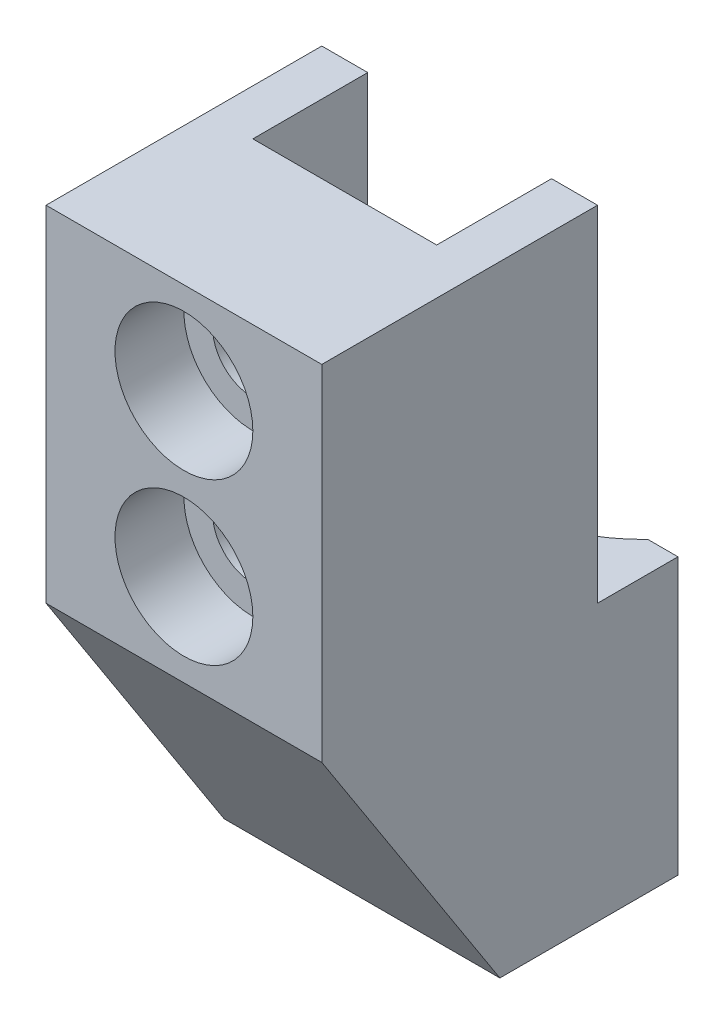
ISO-10303-21;
HEADER;
FILE_DESCRIPTION(('STEP AP214'),'2;1');
FILE_NAME('part.step','',(''),(''),'','','');
FILE_SCHEMA(('AUTOMOTIVE_DESIGN { 1 0 10303 214 1 1 1 1 }'));
ENDSEC;
DATA;
#1=APPLICATION_CONTEXT('core data for automotive mechanical design processes');
#2=APPLICATION_PROTOCOL_DEFINITION('international standard','automotive_design',2000,#1);
#3=PRODUCT_CONTEXT('',#1,'mechanical');
#4=PRODUCT('Part','Part','',(#3));
#5=PRODUCT_RELATED_PRODUCT_CATEGORY('part','',(#4));
#6=PRODUCT_DEFINITION_FORMATION('','',#4);
#7=PRODUCT_DEFINITION_CONTEXT('part definition',#1,'design');
#8=PRODUCT_DEFINITION('design','',#6,#7);
#9=PRODUCT_DEFINITION_SHAPE('','',#8);
#10=(LENGTH_UNIT() NAMED_UNIT(*) SI_UNIT(.MILLI.,.METRE.));
#11=(NAMED_UNIT(*) PLANE_ANGLE_UNIT() SI_UNIT($,.RADIAN.));
#12=(NAMED_UNIT(*) SI_UNIT($,.STERADIAN.) SOLID_ANGLE_UNIT());
#13=UNCERTAINTY_MEASURE_WITH_UNIT(LENGTH_MEASURE(1.E-05),#10,'distance_accuracy_value','');
#14=(GEOMETRIC_REPRESENTATION_CONTEXT(3) GLOBAL_UNCERTAINTY_ASSIGNED_CONTEXT((#13)) GLOBAL_UNIT_ASSIGNED_CONTEXT((#10,
#11,#12)) REPRESENTATION_CONTEXT('',''));
#15=CARTESIAN_POINT('',(0.,0.,0.));
#16=DIRECTION('',(0.,0.,1.));
#17=DIRECTION('',(1.,0.,0.));
#18=AXIS2_PLACEMENT_3D('',#15,#16,#17);
#19=CARTESIAN_POINT('',(6.,-9.,20.));
#20=DIRECTION('',(0.,0.,-1.));
#21=DIRECTION('',(-1.,0.,0.));
#22=AXIS2_PLACEMENT_3D('',#19,#20,#21);
#23=CYLINDRICAL_SURFACE('',#22,1.75);
#24=CARTESIAN_POINT('',(6.,-9.,13.));
#25=DIRECTION('',(0.,0.,-1.));
#26=DIRECTION('',(-1.,0.,0.));
#27=AXIS2_PLACEMENT_3D('',#24,#25,#26);
#28=CIRCLE('',#27,1.75);
#29=CARTESIAN_POINT('',(4.25,-9.,13.));
#30=VERTEX_POINT('',#29);
#31=EDGE_CURVE('E169',#30,#30,#28,.F.);
#32=ORIENTED_EDGE('',*,*,#31,.F.);
#33=EDGE_LOOP('',(#32));
#34=FACE_BOUND('',#33,.T.);
#35=CARTESIAN_POINT('',(6.,-9.,17.));
#36=DIRECTION('',(0.,0.,-1.));
#37=DIRECTION('',(-1.,0.,0.));
#38=AXIS2_PLACEMENT_3D('',#35,#36,#37);
#39=CIRCLE('',#38,1.75);
#40=CARTESIAN_POINT('',(4.25,-9.,17.));
#41=VERTEX_POINT('',#40);
#42=EDGE_CURVE('E20',#41,#41,#39,.T.);
#43=ORIENTED_EDGE('',*,*,#42,.F.);
#44=EDGE_LOOP('',(#43));
#45=FACE_BOUND('',#44,.T.);
#46=ADVANCED_FACE('F17',(#34,#45),#23,.F.);
#47=CARTESIAN_POINT('',(6.,-2.,20.));
#48=DIRECTION('',(0.,0.,-1.));
#49=DIRECTION('',(-1.,0.,0.));
#50=AXIS2_PLACEMENT_3D('',#47,#48,#49);
#51=CYLINDRICAL_SURFACE('',#50,1.75);
#52=CARTESIAN_POINT('',(6.,-2.,13.));
#53=DIRECTION('',(0.,0.,-1.));
#54=DIRECTION('',(-1.,0.,0.));
#55=AXIS2_PLACEMENT_3D('',#52,#53,#54);
#56=CIRCLE('',#55,1.75);
#57=CARTESIAN_POINT('',(4.25,-2.,13.));
#58=VERTEX_POINT('',#57);
#59=EDGE_CURVE('E166',#58,#58,#56,.F.);
#60=ORIENTED_EDGE('',*,*,#59,.F.);
#61=EDGE_LOOP('',(#60));
#62=FACE_BOUND('',#61,.T.);
#63=CARTESIAN_POINT('',(6.,-2.,17.));
#64=DIRECTION('',(0.,0.,-1.));
#65=DIRECTION('',(-1.,0.,0.));
#66=AXIS2_PLACEMENT_3D('',#63,#64,#65);
#67=CIRCLE('',#66,1.75);
#68=CARTESIAN_POINT('',(4.25,-2.,17.));
#69=VERTEX_POINT('',#68);
#70=EDGE_CURVE('E177',#69,#69,#67,.T.);
#71=ORIENTED_EDGE('',*,*,#70,.F.);
#72=EDGE_LOOP('',(#71));
#73=FACE_BOUND('',#72,.T.);
#74=ADVANCED_FACE('F185',(#62,#73),#51,.F.);
#75=CARTESIAN_POINT('',(6.,-13.,13.));
#76=DIRECTION('',(0.,0.,-1.));
#77=DIRECTION('',(-1.,0.,0.));
#78=AXIS2_PLACEMENT_3D('',#75,#76,#77);
#79=CYLINDRICAL_SURFACE('',#78,4.);
#80=CARTESIAN_POINT('',(2.,-13.,6.34428877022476));
#81=CARTESIAN_POINT('',(1.99997997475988,-13.1036428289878,6.34425441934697));
#82=CARTESIAN_POINT('',(2.00402744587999,-13.2072663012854,6.34682760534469));
#83=CARTESIAN_POINT('',(2.02009936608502,-13.4135774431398,6.35692958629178));
#84=CARTESIAN_POINT('',(2.03211809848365,-13.5162657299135,6.36445482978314));
#85=CARTESIAN_POINT('',(2.06387251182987,-13.7193053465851,6.38413865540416));
#86=CARTESIAN_POINT('',(2.08355807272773,-13.8196674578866,6.39626713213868));
#87=CARTESIAN_POINT('',(2.13037088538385,-14.018020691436,6.42469608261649));
#88=CARTESIAN_POINT('',(2.15749917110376,-14.1160114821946,6.44099713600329));
#89=CARTESIAN_POINT('',(2.24943535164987,-14.4049846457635,6.49525586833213));
#90=CARTESIAN_POINT('',(2.32490728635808,-14.5916714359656,6.53864362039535));
#91=CARTESIAN_POINT('',(2.50170842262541,-14.9498760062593,6.6349116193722));
#92=CARTESIAN_POINT('',(2.60308351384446,-15.1213661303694,6.68780866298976));
#93=CARTESIAN_POINT('',(2.83988742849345,-15.4618330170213,6.8031330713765));
#94=CARTESIAN_POINT('',(2.97761943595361,-15.6290631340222,6.86598894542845));
#95=CARTESIAN_POINT('',(3.2785527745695,-15.9394593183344,6.99072214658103));
#96=CARTESIAN_POINT('',(3.44176170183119,-16.0826181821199,7.05259917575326));
#97=CARTESIAN_POINT('',(3.71034117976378,-16.2819576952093,7.14264524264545));
#98=CARTESIAN_POINT('',(3.80781769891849,-16.3478730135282,7.17323565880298));
#99=CARTESIAN_POINT('',(4.00880399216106,-16.471169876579,7.23160192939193));
#100=CARTESIAN_POINT('',(4.11231113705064,-16.5285551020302,7.25937899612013));
#101=CARTESIAN_POINT('',(4.32473504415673,-16.6342209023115,7.31132311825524));
#102=CARTESIAN_POINT('',(4.43365154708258,-16.6825019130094,7.33549034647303));
#103=CARTESIAN_POINT('',(4.6560730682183,-16.7693634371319,7.37947812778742));
#104=CARTESIAN_POINT('',(4.76957531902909,-16.8079497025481,7.39930125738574));
#105=CARTESIAN_POINT('',(4.99120573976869,-16.8722838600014,7.4326231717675));
#106=CARTESIAN_POINT('',(5.09905387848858,-16.8988031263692,7.44649689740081));
#107=CARTESIAN_POINT('',(5.31701122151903,-16.9428261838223,7.46964034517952));
#108=CARTESIAN_POINT('',(5.4271192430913,-16.9603345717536,7.47891241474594));
#109=CARTESIAN_POINT('',(5.64867549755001,-16.9861013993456,7.49258866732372));
#110=CARTESIAN_POINT('',(5.76012325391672,-16.9943630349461,7.49699453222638));
#111=CARTESIAN_POINT('',(5.98339960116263,-17.0015246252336,7.50081262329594));
#112=CARTESIAN_POINT('',(6.09522816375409,-17.000425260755,7.50022521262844));
#113=CARTESIAN_POINT('',(6.30722257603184,-16.9894530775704,7.49437900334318));
#114=CARTESIAN_POINT('',(6.40744765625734,-16.9804590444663,7.48958813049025));
#115=CARTESIAN_POINT('',(6.60668690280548,-16.9550013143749,7.47609030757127));
#116=CARTESIAN_POINT('',(6.70570067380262,-16.9385352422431,7.46738211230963));
#117=CARTESIAN_POINT('',(6.99981606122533,-16.8781849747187,7.43566337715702));
#118=CARTESIAN_POINT('',(7.19219434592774,-16.8233378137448,7.40705252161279));
#119=CARTESIAN_POINT('',(7.56677150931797,-16.6858642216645,7.33703494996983));
#120=CARTESIAN_POINT('',(7.74882056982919,-16.6029124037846,7.29547883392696));
#121=CARTESIAN_POINT('',(8.09683170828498,-16.4121398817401,7.20317484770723));
#122=CARTESIAN_POINT('',(8.26278823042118,-16.3043106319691,7.15242382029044));
#123=CARTESIAN_POINT('',(8.59222409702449,-16.0540908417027,7.04014988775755));
#124=CARTESIAN_POINT('',(8.75367042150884,-15.9092786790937,6.97805575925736));
#125=CARTESIAN_POINT('',(9.05117448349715,-15.5956078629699,6.85320505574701));
#126=CARTESIAN_POINT('',(9.18720375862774,-15.426722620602,6.79044782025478));
#127=CARTESIAN_POINT('',(9.44083544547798,-15.0531632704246,6.66574839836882));
#128=CARTESIAN_POINT('',(9.5560921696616,-14.8467067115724,6.60427331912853));
#129=CARTESIAN_POINT('',(9.70093571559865,-14.5222055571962,6.52350624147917));
#130=CARTESIAN_POINT('',(9.74452312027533,-14.4116495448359,6.49850462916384));
#131=CARTESIAN_POINT('',(9.8219121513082,-14.186245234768,6.4532928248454));
#132=CARTESIAN_POINT('',(9.85571790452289,-14.0713987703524,6.43308061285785));
#133=CARTESIAN_POINT('',(9.92240157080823,-13.8000642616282,6.39271373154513));
#134=CARTESIAN_POINT('',(9.9513592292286,-13.6422427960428,6.37474032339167));
#135=CARTESIAN_POINT('',(9.98046676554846,-13.4029783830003,6.35657138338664));
#136=CARTESIAN_POINT('',(9.98778129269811,-13.3226595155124,6.35197997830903));
#137=CARTESIAN_POINT('',(9.99755029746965,-13.1615712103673,6.34583398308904));
#138=CARTESIAN_POINT('',(10.0000023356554,-13.0808015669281,6.34428091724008));
#139=CARTESIAN_POINT('',(10.,-13.,6.34428877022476));
#140=B_SPLINE_CURVE_WITH_KNOTS('',3,(#80,#81,#82,#83,#84,#85,#86,#87,#88,#89,#90,#91,#92,#93,
#94,#95,#96,#97,#98,#99,#100,#101,#102,#103,#104,#105,#106,#107,#108,#109,#110,#111,#112,#113,
#114,#115,#116,#117,#118,#119,#120,#121,#122,#123,#124,#125,#126,#127,#128,#129,#130,#131,#132,
#133,#134,#135,#136,#137,#138,#139),.UNSPECIFIED.,.F.,.F.,(4,2,2,2,2,2,2,2,2,2,2,2,2,2,2,2,2,2,
2,2,2,2,2,2,2,2,2,2,2,4),(0.,0.310785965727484,0.621349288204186,0.929915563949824,
1.23852472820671,1.85362075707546,2.46981412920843,3.14384278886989,3.81807279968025,
4.18241517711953,4.54659988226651,4.91076714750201,5.27471783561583,5.6100263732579,
5.94516368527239,6.28018512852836,6.61518220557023,6.91703548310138,7.21898477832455,
7.82228211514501,8.43281750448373,9.0435629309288,9.71750167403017,10.3921906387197,
11.1208706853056,11.4847148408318,11.8484052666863,12.3310545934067,12.57322380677,
12.8155144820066),.UNSPECIFIED.);
#141=CARTESIAN_POINT('',(2.,-13.,6.34428877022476));
#142=VERTEX_POINT('',#141);
#143=CARTESIAN_POINT('',(10.,-13.,6.34428877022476));
#144=VERTEX_POINT('',#143);
#145=EDGE_CURVE('E124',#142,#144,#140,.T.);
#146=ORIENTED_EDGE('',*,*,#145,.F.);
#147=DIRECTION('',(0.,0.,-1.));
#148=VECTOR('',#147,1.);
#149=CARTESIAN_POINT('',(2.,-13.,13.));
#150=LINE('',#149,#148);
#151=CARTESIAN_POINT('',(2.,-13.,8.));
#152=VERTEX_POINT('',#151);
#153=EDGE_CURVE('E116',#152,#142,#150,.T.);
#154=ORIENTED_EDGE('',*,*,#153,.F.);
#155=DIRECTION('',(0.,0.,1.));
#156=VECTOR('',#155,1.);
#157=CARTESIAN_POINT('',(2.,-13.,13.));
#158=LINE('',#157,#156);
#159=CARTESIAN_POINT('',(2.,-13.,13.));
#160=VERTEX_POINT('',#159);
#161=EDGE_CURVE('E171',#152,#160,#158,.T.);
#162=ORIENTED_EDGE('',*,*,#161,.T.);
#163=CARTESIAN_POINT('',(6.,-13.,13.));
#164=DIRECTION('',(0.,0.,-1.));
#165=DIRECTION('',(-1.,0.,0.));
#166=AXIS2_PLACEMENT_3D('',#163,#164,#165);
#167=CIRCLE('',#166,4.);
#168=CARTESIAN_POINT('',(10.,-13.,13.));
#169=VERTEX_POINT('',#168);
#170=EDGE_CURVE('E162',#169,#160,#167,.T.);
#171=ORIENTED_EDGE('',*,*,#170,.F.);
#172=DIRECTION('',(0.,0.,1.));
#173=VECTOR('',#172,1.);
#174=CARTESIAN_POINT('',(10.,-13.,13.));
#175=LINE('',#174,#173);
#176=CARTESIAN_POINT('',(10.,-13.,8.));
#177=VERTEX_POINT('',#176);
#178=EDGE_CURVE('E127',#169,#177,#175,.F.);
#179=ORIENTED_EDGE('',*,*,#178,.T.);
#180=DIRECTION('',(0.,0.,-1.));
#181=VECTOR('',#180,1.);
#182=CARTESIAN_POINT('',(10.,-13.,13.));
#183=LINE('',#182,#181);
#184=EDGE_CURVE('E121',#144,#177,#183,.F.);
#185=ORIENTED_EDGE('',*,*,#184,.F.);
#186=EDGE_LOOP('',(#146,#154,#162,#171,#179,#185));
#187=FACE_BOUND('',#186,.T.);
#188=ADVANCED_FACE('F123',(#187),#79,.F.);
#189=CARTESIAN_POINT('',(6.,-9.,17.));
#190=DIRECTION('',(0.,0.,1.));
#191=DIRECTION('',(1.,0.,0.));
#192=AXIS2_PLACEMENT_3D('',#189,#190,#191);
#193=PLANE('',#192);
#194=ORIENTED_EDGE('',*,*,#42,.T.);
#195=EDGE_LOOP('',(#194));
#196=FACE_BOUND('',#195,.T.);
#197=CARTESIAN_POINT('',(6.,-9.,17.));
#198=DIRECTION('',(0.,0.,1.));
#199=DIRECTION('',(1.,0.,0.));
#200=AXIS2_PLACEMENT_3D('',#197,#198,#199);
#201=CIRCLE('',#200,3.);
#202=CARTESIAN_POINT('',(9.,-9.,17.));
#203=VERTEX_POINT('',#202);
#204=EDGE_CURVE('E158',#203,#203,#201,.T.);
#205=ORIENTED_EDGE('',*,*,#204,.T.);
#206=EDGE_LOOP('',(#205));
#207=FACE_BOUND('',#206,.T.);
#208=ADVANCED_FACE('F184',(#196,#207),#193,.T.);
#209=CARTESIAN_POINT('',(6.,-2.,17.));
#210=DIRECTION('',(0.,0.,1.));
#211=DIRECTION('',(1.,0.,0.));
#212=AXIS2_PLACEMENT_3D('',#209,#210,#211);
#213=PLANE('',#212);
#214=ORIENTED_EDGE('',*,*,#70,.T.);
#215=EDGE_LOOP('',(#214));
#216=FACE_BOUND('',#215,.T.);
#217=CARTESIAN_POINT('',(6.,-2.,17.));
#218=DIRECTION('',(0.,0.,1.));
#219=DIRECTION('',(1.,0.,0.));
#220=AXIS2_PLACEMENT_3D('',#217,#218,#219);
#221=CIRCLE('',#220,3.);
#222=CARTESIAN_POINT('',(9.,-2.,17.));
#223=VERTEX_POINT('',#222);
#224=EDGE_CURVE('E154',#223,#223,#221,.T.);
#225=ORIENTED_EDGE('',*,*,#224,.T.);
#226=EDGE_LOOP('',(#225));
#227=FACE_BOUND('',#226,.T.);
#228=ADVANCED_FACE('F428',(#216,#227),#213,.T.);
#229=CARTESIAN_POINT('',(17.2970416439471,2.,4.5));
#230=DIRECTION('',(0.,0.,1.));
#231=DIRECTION('',(1.,0.,0.));
#232=AXIS2_PLACEMENT_3D('',#229,#230,#231);
#233=PLANE('',#232);
#234=DIRECTION('',(1.,0.,0.));
#235=VECTOR('',#234,1.);
#236=CARTESIAN_POINT('',(17.2970416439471,-25.,4.5));
#237=LINE('',#236,#235);
#238=CARTESIAN_POINT('',(0.,-25.,4.5));
#239=VERTEX_POINT('',#238);
#240=CARTESIAN_POINT('',(1.30958424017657,-25.,4.5));
#241=VERTEX_POINT('',#240);
#242=EDGE_CURVE('E134',#239,#241,#237,.T.);
#243=ORIENTED_EDGE('',*,*,#242,.F.);
#244=DIRECTION('',(0.,1.,0.));
#245=VECTOR('',#244,1.);
#246=CARTESIAN_POINT('',(0.,0.,4.5));
#247=LINE('',#246,#245);
#248=CARTESIAN_POINT('',(0.,-13.,4.5));
#249=VERTEX_POINT('',#248);
#250=EDGE_CURVE('E157',#239,#249,#247,.T.);
#251=ORIENTED_EDGE('',*,*,#250,.T.);
#252=DIRECTION('',(1.,0.,0.));
#253=VECTOR('',#252,1.);
#254=CARTESIAN_POINT('',(17.2970416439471,-13.,4.5));
#255=LINE('',#254,#253);
#256=CARTESIAN_POINT('',(1.30958424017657,-13.,4.5));
#257=VERTEX_POINT('',#256);
#258=EDGE_CURVE('E282',#257,#249,#255,.F.);
#259=ORIENTED_EDGE('',*,*,#258,.F.);
#260=DIRECTION('',(0.,1.,0.));
#261=VECTOR('',#260,1.);
#262=CARTESIAN_POINT('',(1.30958424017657,-25.,4.5));
#263=LINE('',#262,#261);
#264=EDGE_CURVE('E133',#257,#241,#263,.F.);
#265=ORIENTED_EDGE('',*,*,#264,.T.);
#266=EDGE_LOOP('',(#243,#251,#259,#265));
#267=FACE_BOUND('',#266,.T.);
#268=ADVANCED_FACE('F262',(#267),#233,.F.);
#269=CARTESIAN_POINT('',(6.,8.21320343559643,0.));
#270=DIRECTION('',(0.,-1.,0.));
#271=DIRECTION('',(0.,0.,-1.));
#272=AXIS2_PLACEMENT_3D('',#269,#270,#271);
#273=CYLINDRICAL_SURFACE('',#272,7.5);
#274=ORIENTED_EDGE('',*,*,#145,.T.);
#275=CARTESIAN_POINT('',(6.,-13.,0.));
#276=DIRECTION('',(0.,-1.,0.));
#277=DIRECTION('',(0.,0.,-1.));
#278=AXIS2_PLACEMENT_3D('',#275,#276,#277);
#279=CIRCLE('',#278,7.5);
#280=EDGE_CURVE('E132',#144,#142,#279,.T.);
#281=ORIENTED_EDGE('',*,*,#280,.T.);
#282=EDGE_LOOP('',(#274,#281));
#283=FACE_BOUND('',#282,.T.);
#284=ADVANCED_FACE('F131',(#283),#273,.T.);
#285=CARTESIAN_POINT('',(6.,-25.,0.));
#286=DIRECTION('',(0.,1.,0.));
#287=DIRECTION('',(0.,0.,1.));
#288=AXIS2_PLACEMENT_3D('',#285,#286,#287);
#289=CYLINDRICAL_SURFACE('',#288,6.5);
#290=DIRECTION('',(0.,1.,0.));
#291=VECTOR('',#290,1.);
#292=CARTESIAN_POINT('',(10.6904157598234,2.,4.5));
#293=LINE('',#292,#291);
#294=CARTESIAN_POINT('',(10.6904157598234,-13.,4.5));
#295=VERTEX_POINT('',#294);
#296=CARTESIAN_POINT('',(10.6904157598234,-25.,4.5));
#297=VERTEX_POINT('',#296);
#298=EDGE_CURVE('E143',#295,#297,#293,.F.);
#299=ORIENTED_EDGE('',*,*,#298,.T.);
#300=CARTESIAN_POINT('',(6.,-25.,0.));
#301=DIRECTION('',(0.,1.,0.));
#302=DIRECTION('',(0.,0.,1.));
#303=AXIS2_PLACEMENT_3D('',#300,#301,#302);
#304=CIRCLE('',#303,6.5);
#305=EDGE_CURVE('E149',#297,#241,#304,.F.);
#306=ORIENTED_EDGE('',*,*,#305,.T.);
#307=ORIENTED_EDGE('',*,*,#264,.F.);
#308=CARTESIAN_POINT('',(6.,-13.,0.));
#309=DIRECTION('',(0.,1.,0.));
#310=DIRECTION('',(0.,0.,1.));
#311=AXIS2_PLACEMENT_3D('',#308,#309,#310);
#312=CIRCLE('',#311,6.5);
#313=EDGE_CURVE('E147',#257,#295,#312,.T.);
#314=ORIENTED_EDGE('',*,*,#313,.T.);
#315=EDGE_LOOP('',(#299,#306,#307,#314));
#316=FACE_BOUND('',#315,.T.);
#317=ADVANCED_FACE('F255',(#316),#289,.F.);
#318=CARTESIAN_POINT('',(10.,2.,13.));
#319=DIRECTION('',(1.,0.,0.));
#320=DIRECTION('',(0.,1.,0.));
#321=AXIS2_PLACEMENT_3D('',#318,#319,#320);
#322=PLANE('',#321);
#323=DIRECTION('',(0.,1.,0.));
#324=VECTOR('',#323,1.);
#325=CARTESIAN_POINT('',(10.,2.,13.));
#326=LINE('',#325,#324);
#327=CARTESIAN_POINT('',(10.,2.,13.));
#328=VERTEX_POINT('',#327);
#329=EDGE_CURVE('E165',#328,#169,#326,.F.);
#330=ORIENTED_EDGE('',*,*,#329,.F.);
#331=DIRECTION('',(0.,0.,-1.));
#332=VECTOR('',#331,1.);
#333=CARTESIAN_POINT('',(10.,2.,20.));
#334=LINE('',#333,#332);
#335=CARTESIAN_POINT('',(10.,2.,8.));
#336=VERTEX_POINT('',#335);
#337=EDGE_CURVE('E319',#328,#336,#334,.T.);
#338=ORIENTED_EDGE('',*,*,#337,.T.);
#339=DIRECTION('',(0.,1.,0.));
#340=VECTOR('',#339,1.);
#341=CARTESIAN_POINT('',(10.,-13.,8.));
#342=LINE('',#341,#340);
#343=EDGE_CURVE('E334',#336,#177,#342,.F.);
#344=ORIENTED_EDGE('',*,*,#343,.T.);
#345=ORIENTED_EDGE('',*,*,#178,.F.);
#346=EDGE_LOOP('',(#330,#338,#344,#345));
#347=FACE_BOUND('',#346,.T.);
#348=ADVANCED_FACE('F252',(#347),#322,.F.);
#349=CARTESIAN_POINT('',(12.,-13.,8.));
#350=DIRECTION('',(0.,0.,1.));
#351=DIRECTION('',(1.,0.,0.));
#352=AXIS2_PLACEMENT_3D('',#349,#350,#351);
#353=PLANE('',#352);
#354=DIRECTION('',(0.,-1.,0.));
#355=VECTOR('',#354,1.);
#356=CARTESIAN_POINT('',(2.,2.,8.));
#357=LINE('',#356,#355);
#358=CARTESIAN_POINT('',(2.,2.,8.));
#359=VERTEX_POINT('',#358);
#360=EDGE_CURVE('E286',#359,#152,#357,.T.);
#361=ORIENTED_EDGE('',*,*,#360,.T.);
#362=DIRECTION('',(1.,0.,0.));
#363=VECTOR('',#362,1.);
#364=CARTESIAN_POINT('',(0.,-13.,8.));
#365=LINE('',#364,#363);
#366=CARTESIAN_POINT('',(0.,-13.,8.));
#367=VERTEX_POINT('',#366);
#368=EDGE_CURVE('E138',#152,#367,#365,.F.);
#369=ORIENTED_EDGE('',*,*,#368,.T.);
#370=DIRECTION('',(0.,1.,0.));
#371=VECTOR('',#370,1.);
#372=CARTESIAN_POINT('',(0.,0.,8.));
#373=LINE('',#372,#371);
#374=CARTESIAN_POINT('',(0.,2.,8.));
#375=VERTEX_POINT('',#374);
#376=EDGE_CURVE('E348',#367,#375,#373,.T.);
#377=ORIENTED_EDGE('',*,*,#376,.T.);
#378=DIRECTION('',(1.,0.,0.));
#379=VECTOR('',#378,1.);
#380=CARTESIAN_POINT('',(0.,2.,8.));
#381=LINE('',#380,#379);
#382=EDGE_CURVE('E304',#375,#359,#381,.T.);
#383=ORIENTED_EDGE('',*,*,#382,.T.);
#384=EDGE_LOOP('',(#361,#369,#377,#383));
#385=FACE_BOUND('',#384,.T.);
#386=ADVANCED_FACE('F248',(#385),#353,.F.);
#387=CARTESIAN_POINT('',(2.,2.,13.));
#388=DIRECTION('',(-1.,0.,0.));
#389=DIRECTION('',(0.,-1.,0.));
#390=AXIS2_PLACEMENT_3D('',#387,#388,#389);
#391=PLANE('',#390);
#392=DIRECTION('',(0.,1.,0.));
#393=VECTOR('',#392,1.);
#394=CARTESIAN_POINT('',(2.,2.,13.));
#395=LINE('',#394,#393);
#396=CARTESIAN_POINT('',(2.,2.,13.));
#397=VERTEX_POINT('',#396);
#398=EDGE_CURVE('E161',#160,#397,#395,.T.);
#399=ORIENTED_EDGE('',*,*,#398,.F.);
#400=ORIENTED_EDGE('',*,*,#161,.F.);
#401=ORIENTED_EDGE('',*,*,#360,.F.);
#402=DIRECTION('',(0.,0.,-1.));
#403=VECTOR('',#402,1.);
#404=CARTESIAN_POINT('',(2.,2.,20.));
#405=LINE('',#404,#403);
#406=EDGE_CURVE('E301',#359,#397,#405,.F.);
#407=ORIENTED_EDGE('',*,*,#406,.T.);
#408=EDGE_LOOP('',(#399,#400,#401,#407));
#409=FACE_BOUND('',#408,.T.);
#410=ADVANCED_FACE('F244',(#409),#391,.F.);
#411=CARTESIAN_POINT('',(6.,2.,13.));
#412=DIRECTION('',(0.,0.,-1.));
#413=DIRECTION('',(-1.,0.,0.));
#414=AXIS2_PLACEMENT_3D('',#411,#412,#413);
#415=PLANE('',#414);
#416=ORIENTED_EDGE('',*,*,#170,.T.);
#417=ORIENTED_EDGE('',*,*,#398,.T.);
#418=DIRECTION('',(1.,0.,0.));
#419=VECTOR('',#418,1.);
#420=CARTESIAN_POINT('',(0.,2.,13.));
#421=LINE('',#420,#419);
#422=EDGE_CURVE('E303',#397,#328,#421,.T.);
#423=ORIENTED_EDGE('',*,*,#422,.T.);
#424=ORIENTED_EDGE('',*,*,#329,.T.);
#425=EDGE_LOOP('',(#416,#417,#423,#424));
#426=FACE_BOUND('',#425,.T.);
#427=ORIENTED_EDGE('',*,*,#59,.T.);
#428=EDGE_LOOP('',(#427));
#429=FACE_BOUND('',#428,.T.);
#430=ORIENTED_EDGE('',*,*,#31,.T.);
#431=EDGE_LOOP('',(#430));
#432=FACE_BOUND('',#431,.T.);
#433=ADVANCED_FACE('F240',(#426,#429,#432),#415,.T.);
#434=CARTESIAN_POINT('',(6.,-9.,17.));
#435=DIRECTION('',(0.,0.,1.));
#436=DIRECTION('',(1.,0.,0.));
#437=AXIS2_PLACEMENT_3D('',#434,#435,#436);
#438=CYLINDRICAL_SURFACE('',#437,3.);
#439=ORIENTED_EDGE('',*,*,#204,.F.);
#440=EDGE_LOOP('',(#439));
#441=FACE_BOUND('',#440,.T.);
#442=CARTESIAN_POINT('',(6.,-9.,20.));
#443=DIRECTION('',(0.,0.,1.));
#444=DIRECTION('',(1.,0.,0.));
#445=AXIS2_PLACEMENT_3D('',#442,#443,#444);
#446=CIRCLE('',#445,3.);
#447=CARTESIAN_POINT('',(9.,-9.,20.));
#448=VERTEX_POINT('',#447);
#449=EDGE_CURVE('E309',#448,#448,#446,.T.);
#450=ORIENTED_EDGE('',*,*,#449,.T.);
#451=EDGE_LOOP('',(#450));
#452=FACE_BOUND('',#451,.T.);
#453=ADVANCED_FACE('F236',(#441,#452),#438,.F.);
#454=CARTESIAN_POINT('',(6.,-2.,17.));
#455=DIRECTION('',(0.,0.,1.));
#456=DIRECTION('',(1.,0.,0.));
#457=AXIS2_PLACEMENT_3D('',#454,#455,#456);
#458=CYLINDRICAL_SURFACE('',#457,3.);
#459=ORIENTED_EDGE('',*,*,#224,.F.);
#460=EDGE_LOOP('',(#459));
#461=FACE_BOUND('',#460,.T.);
#462=CARTESIAN_POINT('',(6.,-2.,20.));
#463=DIRECTION('',(0.,0.,1.));
#464=DIRECTION('',(1.,0.,0.));
#465=AXIS2_PLACEMENT_3D('',#462,#463,#464);
#466=CIRCLE('',#465,3.);
#467=CARTESIAN_POINT('',(9.,-2.,20.));
#468=VERTEX_POINT('',#467);
#469=EDGE_CURVE('E358',#468,#468,#466,.T.);
#470=ORIENTED_EDGE('',*,*,#469,.T.);
#471=EDGE_LOOP('',(#470));
#472=FACE_BOUND('',#471,.T.);
#473=ADVANCED_FACE('F232',(#461,#472),#458,.F.);
#474=CARTESIAN_POINT('',(0.,0.,0.));
#475=DIRECTION('',(1.,0.,0.));
#476=DIRECTION('',(0.,0.,-1.));
#477=AXIS2_PLACEMENT_3D('',#474,#475,#476);
#478=PLANE('',#477);
#479=DIRECTION('',(0.,0.840039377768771,0.542525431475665));
#480=VECTOR('',#479,1.);
#481=CARTESIAN_POINT('',(0.,-25.,12.25));
#482=LINE('',#481,#480);
#483=CARTESIAN_POINT('',(0.,-25.,12.25));
#484=VERTEX_POINT('',#483);
#485=CARTESIAN_POINT('',(0.,-13.,20.));
#486=VERTEX_POINT('',#485);
#487=EDGE_CURVE('E380',#484,#486,#482,.T.);
#488=ORIENTED_EDGE('',*,*,#487,.T.);
#489=DIRECTION('',(0.,1.,0.));
#490=VECTOR('',#489,1.);
#491=CARTESIAN_POINT('',(0.,25.,20.));
#492=LINE('',#491,#490);
#493=CARTESIAN_POINT('',(0.,2.,20.));
#494=VERTEX_POINT('',#493);
#495=EDGE_CURVE('E369',#486,#494,#492,.T.);
#496=ORIENTED_EDGE('',*,*,#495,.T.);
#497=DIRECTION('',(0.,0.,-1.));
#498=VECTOR('',#497,1.);
#499=CARTESIAN_POINT('',(0.,2.,20.));
#500=LINE('',#499,#498);
#501=EDGE_CURVE('E331',#494,#375,#500,.T.);
#502=ORIENTED_EDGE('',*,*,#501,.T.);
#503=ORIENTED_EDGE('',*,*,#376,.F.);
#504=DIRECTION('',(0.,0.,-1.));
#505=VECTOR('',#504,1.);
#506=CARTESIAN_POINT('',(0.,-13.,7.5));
#507=LINE('',#506,#505);
#508=EDGE_CURVE('E141',#367,#249,#507,.T.);
#509=ORIENTED_EDGE('',*,*,#508,.T.);
#510=ORIENTED_EDGE('',*,*,#250,.F.);
#511=DIRECTION('',(0.,0.,1.));
#512=VECTOR('',#511,1.);
#513=CARTESIAN_POINT('',(0.,-25.,20.));
#514=LINE('',#513,#512);
#515=EDGE_CURVE('E152',#239,#484,#514,.T.);
#516=ORIENTED_EDGE('',*,*,#515,.T.);
#517=EDGE_LOOP('',(#488,#496,#502,#503,#509,#510,#516));
#518=FACE_BOUND('',#517,.T.);
#519=ADVANCED_FACE('F228',(#518),#478,.F.);
#520=CARTESIAN_POINT('',(0.,-25.,12.25));
#521=DIRECTION('',(0.,0.542525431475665,-0.840039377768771));
#522=DIRECTION('',(0.,0.840039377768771,0.542525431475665));
#523=AXIS2_PLACEMENT_3D('',#520,#521,#522);
#524=PLANE('',#523);
#525=DIRECTION('',(1.,0.,0.));
#526=VECTOR('',#525,1.);
#527=CARTESIAN_POINT('',(12.,-13.,20.));
#528=LINE('',#527,#526);
#529=CARTESIAN_POINT('',(12.,-13.,20.));
#530=VERTEX_POINT('',#529);
#531=EDGE_CURVE('E366',#530,#486,#528,.F.);
#532=ORIENTED_EDGE('',*,*,#531,.T.);
#533=ORIENTED_EDGE('',*,*,#487,.F.);
#534=DIRECTION('',(1.,0.,0.));
#535=VECTOR('',#534,1.);
#536=CARTESIAN_POINT('',(12.,-25.,12.25));
#537=LINE('',#536,#535);
#538=CARTESIAN_POINT('',(12.,-25.,12.25));
#539=VERTEX_POINT('',#538);
#540=EDGE_CURVE('E153',#484,#539,#537,.T.);
#541=ORIENTED_EDGE('',*,*,#540,.T.);
#542=DIRECTION('',(0.,-0.840039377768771,-0.542525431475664));
#543=VECTOR('',#542,1.);
#544=CARTESIAN_POINT('',(12.,-13.,20.));
#545=LINE('',#544,#543);
#546=EDGE_CURVE('E295',#530,#539,#545,.T.);
#547=ORIENTED_EDGE('',*,*,#546,.F.);
#548=EDGE_LOOP('',(#532,#533,#541,#547));
#549=FACE_BOUND('',#548,.T.);
#550=ADVANCED_FACE('F224',(#549),#524,.F.);
#551=CARTESIAN_POINT('',(12.,-25.,20.));
#552=DIRECTION('',(0.,1.,0.));
#553=DIRECTION('',(0.,0.,1.));
#554=AXIS2_PLACEMENT_3D('',#551,#552,#553);
#555=PLANE('',#554);
#556=ORIENTED_EDGE('',*,*,#242,.T.);
#557=ORIENTED_EDGE('',*,*,#305,.F.);
#558=DIRECTION('',(1.,0.,0.));
#559=VECTOR('',#558,1.);
#560=CARTESIAN_POINT('',(17.2970416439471,-25.,4.5));
#561=LINE('',#560,#559);
#562=CARTESIAN_POINT('',(12.,-25.,4.5));
#563=VERTEX_POINT('',#562);
#564=EDGE_CURVE('E139',#297,#563,#561,.T.);
#565=ORIENTED_EDGE('',*,*,#564,.T.);
#566=DIRECTION('',(0.,0.,-1.));
#567=VECTOR('',#566,1.);
#568=CARTESIAN_POINT('',(12.,-25.,0.));
#569=LINE('',#568,#567);
#570=EDGE_CURVE('E274',#539,#563,#569,.T.);
#571=ORIENTED_EDGE('',*,*,#570,.F.);
#572=ORIENTED_EDGE('',*,*,#540,.F.);
#573=ORIENTED_EDGE('',*,*,#515,.F.);
#574=EDGE_LOOP('',(#556,#557,#565,#571,#572,#573));
#575=FACE_BOUND('',#574,.T.);
#576=ADVANCED_FACE('F220',(#575),#555,.F.);
#577=CARTESIAN_POINT('',(17.2970416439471,2.,4.5));
#578=DIRECTION('',(0.,0.,1.));
#579=DIRECTION('',(1.,0.,0.));
#580=AXIS2_PLACEMENT_3D('',#577,#578,#579);
#581=PLANE('',#580);
#582=ORIENTED_EDGE('',*,*,#564,.F.);
#583=ORIENTED_EDGE('',*,*,#298,.F.);
#584=DIRECTION('',(1.,0.,0.));
#585=VECTOR('',#584,1.);
#586=CARTESIAN_POINT('',(0.,-13.,4.5));
#587=LINE('',#586,#585);
#588=CARTESIAN_POINT('',(12.,-13.,4.5));
#589=VERTEX_POINT('',#588);
#590=EDGE_CURVE('E336',#295,#589,#587,.T.);
#591=ORIENTED_EDGE('',*,*,#590,.T.);
#592=DIRECTION('',(0.,1.,0.));
#593=VECTOR('',#592,1.);
#594=CARTESIAN_POINT('',(12.,0.,4.5));
#595=LINE('',#594,#593);
#596=EDGE_CURVE('E270',#563,#589,#595,.T.);
#597=ORIENTED_EDGE('',*,*,#596,.F.);
#598=EDGE_LOOP('',(#582,#583,#591,#597));
#599=FACE_BOUND('',#598,.T.);
#600=ADVANCED_FACE('F217',(#599),#581,.F.);
#601=CARTESIAN_POINT('',(0.,-13.,7.5));
#602=DIRECTION('',(0.,-1.,0.));
#603=DIRECTION('',(0.,0.,-1.));
#604=AXIS2_PLACEMENT_3D('',#601,#602,#603);
#605=PLANE('',#604);
#606=ORIENTED_EDGE('',*,*,#590,.F.);
#607=ORIENTED_EDGE('',*,*,#313,.F.);
#608=ORIENTED_EDGE('',*,*,#258,.T.);
#609=ORIENTED_EDGE('',*,*,#508,.F.);
#610=ORIENTED_EDGE('',*,*,#368,.F.);
#611=ORIENTED_EDGE('',*,*,#153,.T.);
#612=ORIENTED_EDGE('',*,*,#280,.F.);
#613=ORIENTED_EDGE('',*,*,#184,.T.);
#614=DIRECTION('',(1.,0.,0.));
#615=VECTOR('',#614,1.);
#616=CARTESIAN_POINT('',(12.,-13.,8.));
#617=LINE('',#616,#615);
#618=CARTESIAN_POINT('',(12.,-13.,8.));
#619=VERTEX_POINT('',#618);
#620=EDGE_CURVE('E322',#177,#619,#617,.T.);
#621=ORIENTED_EDGE('',*,*,#620,.T.);
#622=DIRECTION('',(0.,0.,-1.));
#623=VECTOR('',#622,1.);
#624=CARTESIAN_POINT('',(12.,-13.,0.));
#625=LINE('',#624,#623);
#626=EDGE_CURVE('E391',#589,#619,#625,.F.);
#627=ORIENTED_EDGE('',*,*,#626,.F.);
#628=EDGE_LOOP('',(#606,#607,#608,#609,#610,#611,#612,#613,#621,#627));
#629=FACE_BOUND('',#628,.T.);
#630=ADVANCED_FACE('F137',(#629),#605,.F.);
#631=CARTESIAN_POINT('',(12.,-13.,8.));
#632=DIRECTION('',(0.,0.,1.));
#633=DIRECTION('',(1.,0.,0.));
#634=AXIS2_PLACEMENT_3D('',#631,#632,#633);
#635=PLANE('',#634);
#636=ORIENTED_EDGE('',*,*,#343,.F.);
#637=DIRECTION('',(1.,0.,0.));
#638=VECTOR('',#637,1.);
#639=CARTESIAN_POINT('',(0.,2.,8.));
#640=LINE('',#639,#638);
#641=CARTESIAN_POINT('',(12.,2.,8.));
#642=VERTEX_POINT('',#641);
#643=EDGE_CURVE('E321',#336,#642,#640,.T.);
#644=ORIENTED_EDGE('',*,*,#643,.T.);
#645=DIRECTION('',(0.,1.,0.));
#646=VECTOR('',#645,1.);
#647=CARTESIAN_POINT('',(12.,0.,8.));
#648=LINE('',#647,#646);
#649=EDGE_CURVE('E394',#619,#642,#648,.T.);
#650=ORIENTED_EDGE('',*,*,#649,.F.);
#651=ORIENTED_EDGE('',*,*,#620,.F.);
#652=EDGE_LOOP('',(#636,#644,#650,#651));
#653=FACE_BOUND('',#652,.T.);
#654=ADVANCED_FACE('F211',(#653),#635,.F.);
#655=CARTESIAN_POINT('',(0.,2.,20.));
#656=DIRECTION('',(0.,-1.,0.));
#657=DIRECTION('',(0.,0.,-1.));
#658=AXIS2_PLACEMENT_3D('',#655,#656,#657);
#659=PLANE('',#658);
#660=ORIENTED_EDGE('',*,*,#406,.F.);
#661=ORIENTED_EDGE('',*,*,#382,.F.);
#662=ORIENTED_EDGE('',*,*,#501,.F.);
#663=DIRECTION('',(1.,0.,0.));
#664=VECTOR('',#663,1.);
#665=CARTESIAN_POINT('',(12.,2.,20.));
#666=LINE('',#665,#664);
#667=CARTESIAN_POINT('',(12.,2.,20.));
#668=VERTEX_POINT('',#667);
#669=EDGE_CURVE('E35',#494,#668,#666,.T.);
#670=ORIENTED_EDGE('',*,*,#669,.T.);
#671=DIRECTION('',(0.,0.,-1.));
#672=VECTOR('',#671,1.);
#673=CARTESIAN_POINT('',(12.,2.,0.));
#674=LINE('',#673,#672);
#675=EDGE_CURVE('E26',#642,#668,#674,.F.);
#676=ORIENTED_EDGE('',*,*,#675,.F.);
#677=ORIENTED_EDGE('',*,*,#643,.F.);
#678=ORIENTED_EDGE('',*,*,#337,.F.);
#679=ORIENTED_EDGE('',*,*,#422,.F.);
#680=EDGE_LOOP('',(#660,#661,#662,#670,#676,#677,#678,#679));
#681=FACE_BOUND('',#680,.T.);
#682=ADVANCED_FACE('F204',(#681),#659,.F.);
#683=CARTESIAN_POINT('',(12.,25.,20.));
#684=DIRECTION('',(0.,0.,-1.));
#685=DIRECTION('',(0.,1.,0.));
#686=AXIS2_PLACEMENT_3D('',#683,#684,#685);
#687=PLANE('',#686);
#688=ORIENTED_EDGE('',*,*,#531,.F.);
#689=DIRECTION('',(0.,1.,0.));
#690=VECTOR('',#689,1.);
#691=CARTESIAN_POINT('',(12.,0.,20.));
#692=LINE('',#691,#690);
#693=EDGE_CURVE('E11',#668,#530,#692,.F.);
#694=ORIENTED_EDGE('',*,*,#693,.F.);
#695=ORIENTED_EDGE('',*,*,#669,.F.);
#696=ORIENTED_EDGE('',*,*,#495,.F.);
#697=EDGE_LOOP('',(#688,#694,#695,#696));
#698=FACE_BOUND('',#697,.T.);
#699=ORIENTED_EDGE('',*,*,#469,.F.);
#700=EDGE_LOOP('',(#699));
#701=FACE_BOUND('',#700,.T.);
#702=ORIENTED_EDGE('',*,*,#449,.F.);
#703=EDGE_LOOP('',(#702));
#704=FACE_BOUND('',#703,.T.);
#705=ADVANCED_FACE('F198',(#698,#701,#704),#687,.F.);
#706=CARTESIAN_POINT('',(12.,0.,0.));
#707=DIRECTION('',(1.,0.,0.));
#708=DIRECTION('',(0.,0.,-1.));
#709=AXIS2_PLACEMENT_3D('',#706,#707,#708);
#710=PLANE('',#709);
#711=ORIENTED_EDGE('',*,*,#675,.T.);
#712=ORIENTED_EDGE('',*,*,#693,.T.);
#713=ORIENTED_EDGE('',*,*,#546,.T.);
#714=ORIENTED_EDGE('',*,*,#570,.T.);
#715=ORIENTED_EDGE('',*,*,#596,.T.);
#716=ORIENTED_EDGE('',*,*,#626,.T.);
#717=ORIENTED_EDGE('',*,*,#649,.T.);
#718=EDGE_LOOP('',(#711,#712,#713,#714,#715,#716,#717));
#719=FACE_BOUND('',#718,.T.);
#720=ADVANCED_FACE('F196',(#719),#710,.T.);
#721=CLOSED_SHELL('',(#46,#74,#188,#208,#228,#268,#284,#317,#348,#386,#410,#433,#453,#473,#519,
#550,#576,#600,#630,#654,#682,#705,#720));
#722=MANIFOLD_SOLID_BREP('B1',#721);
#723=ADVANCED_BREP_SHAPE_REPRESENTATION('',(#18,#722),#14);
#724=SHAPE_DEFINITION_REPRESENTATION(#9,#723);
ENDSEC;
END-ISO-10303-21;
